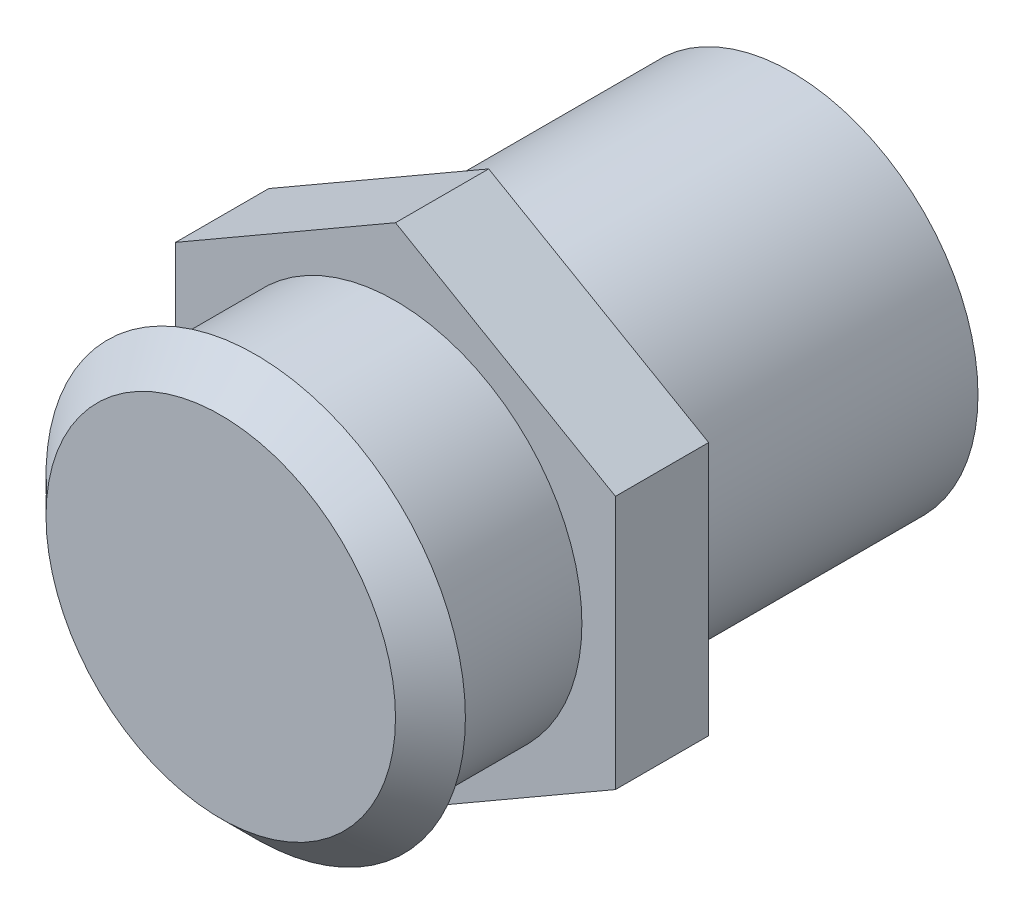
ISO-10303-21;
HEADER;
FILE_DESCRIPTION(('STEP AP214'),'2;1');
FILE_NAME('part.step','',(''),(''),'','','');
FILE_SCHEMA(('AUTOMOTIVE_DESIGN { 1 0 10303 214 1 1 1 1 }'));
ENDSEC;
DATA;
#1=APPLICATION_CONTEXT('core data for automotive mechanical design processes');
#2=APPLICATION_PROTOCOL_DEFINITION('international standard','automotive_design',2000,#1);
#3=PRODUCT_CONTEXT('',#1,'mechanical');
#4=PRODUCT('Part','Part','',(#3));
#5=PRODUCT_RELATED_PRODUCT_CATEGORY('part','',(#4));
#6=PRODUCT_DEFINITION_FORMATION('','',#4);
#7=PRODUCT_DEFINITION_CONTEXT('part definition',#1,'design');
#8=PRODUCT_DEFINITION('design','',#6,#7);
#9=PRODUCT_DEFINITION_SHAPE('','',#8);
#10=(LENGTH_UNIT() NAMED_UNIT(*) SI_UNIT(.MILLI.,.METRE.));
#11=(NAMED_UNIT(*) PLANE_ANGLE_UNIT() SI_UNIT($,.RADIAN.));
#12=(NAMED_UNIT(*) SI_UNIT($,.STERADIAN.) SOLID_ANGLE_UNIT());
#13=UNCERTAINTY_MEASURE_WITH_UNIT(LENGTH_MEASURE(1.E-05),#10,'distance_accuracy_value','');
#14=(GEOMETRIC_REPRESENTATION_CONTEXT(3) GLOBAL_UNCERTAINTY_ASSIGNED_CONTEXT((#13)) GLOBAL_UNIT_ASSIGNED_CONTEXT((#10,
#11,#12)) REPRESENTATION_CONTEXT('',''));
#15=CARTESIAN_POINT('',(0.,0.,0.));
#16=DIRECTION('',(0.,0.,1.));
#17=DIRECTION('',(1.,0.,0.));
#18=AXIS2_PLACEMENT_3D('',#15,#16,#17);
#19=CARTESIAN_POINT('',(0.,0.,23.));
#20=DIRECTION('',(0.,0.,-1.));
#21=DIRECTION('',(-1.,0.,0.));
#22=AXIS2_PLACEMENT_3D('',#19,#20,#21);
#23=CYLINDRICAL_SURFACE('',#22,8.);
#24=CARTESIAN_POINT('',(0.,0.,0.));
#25=DIRECTION('',(0.,0.,1.));
#26=DIRECTION('',(1.,0.,0.));
#27=AXIS2_PLACEMENT_3D('',#24,#25,#26);
#28=CIRCLE('',#27,8.);
#29=CARTESIAN_POINT('',(8.,0.,0.));
#30=VERTEX_POINT('',#29);
#31=EDGE_CURVE('E187',#30,#30,#28,.T.);
#32=ORIENTED_EDGE('',*,*,#31,.T.);
#33=EDGE_LOOP('',(#32));
#34=FACE_BOUND('',#33,.T.);
#35=CARTESIAN_POINT('',(0.,0.,13.));
#36=DIRECTION('',(0.,0.,1.));
#37=DIRECTION('',(1.,0.,0.));
#38=AXIS2_PLACEMENT_3D('',#35,#36,#37);
#39=CIRCLE('',#38,8.);
#40=CARTESIAN_POINT('',(8.,0.,13.));
#41=VERTEX_POINT('',#40);
#42=EDGE_CURVE('E64',#41,#41,#39,.T.);
#43=ORIENTED_EDGE('',*,*,#42,.F.);
#44=EDGE_LOOP('',(#43));
#45=FACE_BOUND('',#44,.T.);
#46=ADVANCED_FACE('F53',(#34,#45),#23,.T.);
#47=CARTESIAN_POINT('',(0.,0.,0.));
#48=DIRECTION('',(0.,0.,1.));
#49=DIRECTION('',(1.,0.,0.));
#50=AXIS2_PLACEMENT_3D('',#47,#48,#49);
#51=PLANE('',#50);
#52=ORIENTED_EDGE('',*,*,#31,.F.);
#53=EDGE_LOOP('',(#52));
#54=FACE_BOUND('',#53,.T.);
#55=ADVANCED_FACE('F199',(#54),#51,.F.);
#56=CARTESIAN_POINT('',(9.43967690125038,5.45,13.));
#57=DIRECTION('',(0.500000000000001,0.866025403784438,0.));
#58=DIRECTION('',(-0.866025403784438,0.500000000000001,0.));
#59=AXIS2_PLACEMENT_3D('',#56,#57,#58);
#60=PLANE('',#59);
#61=DIRECTION('',(-0.866025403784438,0.500000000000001,0.));
#62=VECTOR('',#61,1.);
#63=CARTESIAN_POINT('',(9.43967690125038,5.45,17.));
#64=LINE('',#63,#62);
#65=CARTESIAN_POINT('',(9.43967690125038,5.45,17.));
#66=VERTEX_POINT('',#65);
#67=CARTESIAN_POINT('',(0.,10.9,17.));
#68=VERTEX_POINT('',#67);
#69=EDGE_CURVE('E148',#66,#68,#64,.T.);
#70=ORIENTED_EDGE('',*,*,#69,.F.);
#71=DIRECTION('',(0.,0.,1.));
#72=VECTOR('',#71,1.);
#73=CARTESIAN_POINT('',(9.43967690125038,5.45,13.));
#74=LINE('',#73,#72);
#75=CARTESIAN_POINT('',(9.43967690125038,5.45,13.));
#76=VERTEX_POINT('',#75);
#77=EDGE_CURVE('E72',#76,#66,#74,.T.);
#78=ORIENTED_EDGE('',*,*,#77,.F.);
#79=DIRECTION('',(-0.866025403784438,0.500000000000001,0.));
#80=VECTOR('',#79,1.);
#81=CARTESIAN_POINT('',(9.43967690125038,5.45,13.));
#82=LINE('',#81,#80);
#83=CARTESIAN_POINT('',(0.,10.9,13.));
#84=VERTEX_POINT('',#83);
#85=EDGE_CURVE('E170',#76,#84,#82,.T.);
#86=ORIENTED_EDGE('',*,*,#85,.T.);
#87=DIRECTION('',(0.,0.,1.));
#88=VECTOR('',#87,1.);
#89=CARTESIAN_POINT('',(0.,10.9,13.));
#90=LINE('',#89,#88);
#91=EDGE_CURVE('E107',#84,#68,#90,.T.);
#92=ORIENTED_EDGE('',*,*,#91,.T.);
#93=EDGE_LOOP('',(#70,#78,#86,#92));
#94=FACE_BOUND('',#93,.T.);
#95=ADVANCED_FACE('F206',(#94),#60,.T.);
#96=CARTESIAN_POINT('',(9.43967690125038,-5.45,13.));
#97=DIRECTION('',(1.,0.,0.));
#98=DIRECTION('',(0.,1.,0.));
#99=AXIS2_PLACEMENT_3D('',#96,#97,#98);
#100=PLANE('',#99);
#101=DIRECTION('',(0.,1.,0.));
#102=VECTOR('',#101,1.);
#103=CARTESIAN_POINT('',(9.43967690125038,-5.45,17.));
#104=LINE('',#103,#102);
#105=CARTESIAN_POINT('',(9.43967690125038,-5.45,17.));
#106=VERTEX_POINT('',#105);
#107=EDGE_CURVE('E166',#106,#66,#104,.T.);
#108=ORIENTED_EDGE('',*,*,#107,.F.);
#109=DIRECTION('',(0.,0.,1.));
#110=VECTOR('',#109,1.);
#111=CARTESIAN_POINT('',(9.43967690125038,-5.45,13.));
#112=LINE('',#111,#110);
#113=CARTESIAN_POINT('',(9.43967690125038,-5.45,13.));
#114=VERTEX_POINT('',#113);
#115=EDGE_CURVE('E95',#114,#106,#112,.T.);
#116=ORIENTED_EDGE('',*,*,#115,.F.);
#117=DIRECTION('',(0.,1.,0.));
#118=VECTOR('',#117,1.);
#119=CARTESIAN_POINT('',(9.43967690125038,-5.45,13.));
#120=LINE('',#119,#118);
#121=EDGE_CURVE('E134',#114,#76,#120,.T.);
#122=ORIENTED_EDGE('',*,*,#121,.T.);
#123=ORIENTED_EDGE('',*,*,#77,.T.);
#124=EDGE_LOOP('',(#108,#116,#122,#123));
#125=FACE_BOUND('',#124,.T.);
#126=ADVANCED_FACE('F240',(#125),#100,.T.);
#127=CARTESIAN_POINT('',(0.,-10.9,13.));
#128=DIRECTION('',(0.5,-0.866025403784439,0.));
#129=DIRECTION('',(0.866025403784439,0.5,0.));
#130=AXIS2_PLACEMENT_3D('',#127,#128,#129);
#131=PLANE('',#130);
#132=DIRECTION('',(0.866025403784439,0.5,0.));
#133=VECTOR('',#132,1.);
#134=CARTESIAN_POINT('',(0.,-10.9,17.));
#135=LINE('',#134,#133);
#136=CARTESIAN_POINT('',(0.,-10.9,17.));
#137=VERTEX_POINT('',#136);
#138=EDGE_CURVE('E120',#137,#106,#135,.T.);
#139=ORIENTED_EDGE('',*,*,#138,.F.);
#140=DIRECTION('',(0.,0.,1.));
#141=VECTOR('',#140,1.);
#142=CARTESIAN_POINT('',(0.,-10.9,13.));
#143=LINE('',#142,#141);
#144=CARTESIAN_POINT('',(0.,-10.9,13.));
#145=VERTEX_POINT('',#144);
#146=EDGE_CURVE('E115',#145,#137,#143,.T.);
#147=ORIENTED_EDGE('',*,*,#146,.F.);
#148=DIRECTION('',(0.866025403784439,0.5,0.));
#149=VECTOR('',#148,1.);
#150=CARTESIAN_POINT('',(0.,-10.9,13.));
#151=LINE('',#150,#149);
#152=EDGE_CURVE('E118',#145,#114,#151,.T.);
#153=ORIENTED_EDGE('',*,*,#152,.T.);
#154=ORIENTED_EDGE('',*,*,#115,.T.);
#155=EDGE_LOOP('',(#139,#147,#153,#154));
#156=FACE_BOUND('',#155,.T.);
#157=ADVANCED_FACE('F117',(#156),#131,.T.);
#158=CARTESIAN_POINT('',(-9.43967690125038,-5.45,13.));
#159=DIRECTION('',(-0.5,-0.866025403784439,0.));
#160=DIRECTION('',(0.866025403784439,-0.5,0.));
#161=AXIS2_PLACEMENT_3D('',#158,#159,#160);
#162=PLANE('',#161);
#163=DIRECTION('',(0.866025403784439,-0.5,0.));
#164=VECTOR('',#163,1.);
#165=CARTESIAN_POINT('',(-9.43967690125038,-5.45,17.));
#166=LINE('',#165,#164);
#167=CARTESIAN_POINT('',(-9.43967690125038,-5.45,17.));
#168=VERTEX_POINT('',#167);
#169=EDGE_CURVE('E161',#168,#137,#166,.T.);
#170=ORIENTED_EDGE('',*,*,#169,.F.);
#171=DIRECTION('',(0.,0.,1.));
#172=VECTOR('',#171,1.);
#173=CARTESIAN_POINT('',(-9.43967690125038,-5.45,13.));
#174=LINE('',#173,#172);
#175=CARTESIAN_POINT('',(-9.43967690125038,-5.45,13.));
#176=VERTEX_POINT('',#175);
#177=EDGE_CURVE('E126',#176,#168,#174,.T.);
#178=ORIENTED_EDGE('',*,*,#177,.F.);
#179=DIRECTION('',(0.866025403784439,-0.5,0.));
#180=VECTOR('',#179,1.);
#181=CARTESIAN_POINT('',(-9.43967690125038,-5.45,13.));
#182=LINE('',#181,#180);
#183=EDGE_CURVE('E132',#176,#145,#182,.T.);
#184=ORIENTED_EDGE('',*,*,#183,.T.);
#185=ORIENTED_EDGE('',*,*,#146,.T.);
#186=EDGE_LOOP('',(#170,#178,#184,#185));
#187=FACE_BOUND('',#186,.T.);
#188=ADVANCED_FACE('F137',(#187),#162,.T.);
#189=CARTESIAN_POINT('',(-9.43967690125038,5.45,13.));
#190=DIRECTION('',(-1.,0.,0.));
#191=DIRECTION('',(0.,0.,1.));
#192=AXIS2_PLACEMENT_3D('',#189,#190,#191);
#193=PLANE('',#192);
#194=DIRECTION('',(0.,-1.,0.));
#195=VECTOR('',#194,1.);
#196=CARTESIAN_POINT('',(-9.43967690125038,5.45,17.));
#197=LINE('',#196,#195);
#198=CARTESIAN_POINT('',(-9.43967690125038,5.45,17.));
#199=VERTEX_POINT('',#198);
#200=EDGE_CURVE('E157',#199,#168,#197,.T.);
#201=ORIENTED_EDGE('',*,*,#200,.F.);
#202=DIRECTION('',(0.,0.,1.));
#203=VECTOR('',#202,1.);
#204=CARTESIAN_POINT('',(-9.43967690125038,5.45,13.));
#205=LINE('',#204,#203);
#206=CARTESIAN_POINT('',(-9.43967690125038,5.45,13.));
#207=VERTEX_POINT('',#206);
#208=EDGE_CURVE('E178',#207,#199,#205,.T.);
#209=ORIENTED_EDGE('',*,*,#208,.F.);
#210=DIRECTION('',(0.,-1.,0.));
#211=VECTOR('',#210,1.);
#212=CARTESIAN_POINT('',(-9.43967690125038,5.45,13.));
#213=LINE('',#212,#211);
#214=EDGE_CURVE('E139',#207,#176,#213,.T.);
#215=ORIENTED_EDGE('',*,*,#214,.T.);
#216=ORIENTED_EDGE('',*,*,#177,.T.);
#217=EDGE_LOOP('',(#201,#209,#215,#216));
#218=FACE_BOUND('',#217,.T.);
#219=ADVANCED_FACE('F252',(#218),#193,.T.);
#220=CARTESIAN_POINT('',(0.,10.9,13.));
#221=DIRECTION('',(-0.5,0.866025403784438,0.));
#222=DIRECTION('',(-0.866025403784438,-0.5,0.));
#223=AXIS2_PLACEMENT_3D('',#220,#221,#222);
#224=PLANE('',#223);
#225=DIRECTION('',(-0.866025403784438,-0.5,0.));
#226=VECTOR('',#225,1.);
#227=CARTESIAN_POINT('',(0.,10.9,17.));
#228=LINE('',#227,#226);
#229=EDGE_CURVE('E152',#68,#199,#228,.T.);
#230=ORIENTED_EDGE('',*,*,#229,.F.);
#231=ORIENTED_EDGE('',*,*,#91,.F.);
#232=DIRECTION('',(-0.866025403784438,-0.5,0.));
#233=VECTOR('',#232,1.);
#234=CARTESIAN_POINT('',(0.,10.9,13.));
#235=LINE('',#234,#233);
#236=EDGE_CURVE('E142',#84,#207,#235,.T.);
#237=ORIENTED_EDGE('',*,*,#236,.T.);
#238=ORIENTED_EDGE('',*,*,#208,.T.);
#239=EDGE_LOOP('',(#230,#231,#237,#238));
#240=FACE_BOUND('',#239,.T.);
#241=ADVANCED_FACE('F237',(#240),#224,.T.);
#242=CARTESIAN_POINT('',(0.,0.,13.));
#243=DIRECTION('',(0.,0.,1.));
#244=DIRECTION('',(1.,0.,0.));
#245=AXIS2_PLACEMENT_3D('',#242,#243,#244);
#246=PLANE('',#245);
#247=ORIENTED_EDGE('',*,*,#42,.T.);
#248=EDGE_LOOP('',(#247));
#249=FACE_BOUND('',#248,.T.);
#250=ORIENTED_EDGE('',*,*,#85,.F.);
#251=ORIENTED_EDGE('',*,*,#121,.F.);
#252=ORIENTED_EDGE('',*,*,#152,.F.);
#253=ORIENTED_EDGE('',*,*,#183,.F.);
#254=ORIENTED_EDGE('',*,*,#214,.F.);
#255=ORIENTED_EDGE('',*,*,#236,.F.);
#256=EDGE_LOOP('',(#250,#251,#252,#253,#254,#255));
#257=FACE_BOUND('',#256,.T.);
#258=ADVANCED_FACE('F130',(#249,#257),#246,.F.);
#259=CARTESIAN_POINT('',(0.,0.,17.));
#260=DIRECTION('',(0.,0.,1.));
#261=DIRECTION('',(1.,0.,0.));
#262=AXIS2_PLACEMENT_3D('',#259,#260,#261);
#263=PLANE('',#262);
#264=CARTESIAN_POINT('',(0.,0.,17.));
#265=DIRECTION('',(0.,0.,1.));
#266=DIRECTION('',(1.,0.,0.));
#267=AXIS2_PLACEMENT_3D('',#264,#265,#266);
#268=CIRCLE('',#267,8.);
#269=CARTESIAN_POINT('',(8.,0.,17.));
#270=VERTEX_POINT('',#269);
#271=EDGE_CURVE('E173',#270,#270,#268,.T.);
#272=ORIENTED_EDGE('',*,*,#271,.F.);
#273=EDGE_LOOP('',(#272));
#274=FACE_BOUND('',#273,.T.);
#275=ORIENTED_EDGE('',*,*,#69,.T.);
#276=ORIENTED_EDGE('',*,*,#229,.T.);
#277=ORIENTED_EDGE('',*,*,#200,.T.);
#278=ORIENTED_EDGE('',*,*,#169,.T.);
#279=ORIENTED_EDGE('',*,*,#138,.T.);
#280=ORIENTED_EDGE('',*,*,#107,.T.);
#281=EDGE_LOOP('',(#275,#276,#277,#278,#279,#280));
#282=FACE_BOUND('',#281,.T.);
#283=ADVANCED_FACE('F211',(#274,#282),#263,.T.);
#284=ORIENTED_EDGE('',*,*,#271,.T.);
#285=EDGE_LOOP('',(#284));
#286=FACE_BOUND('',#285,.T.);
#287=CARTESIAN_POINT('',(0.,0.,23.));
#288=DIRECTION('',(0.,0.,1.));
#289=DIRECTION('',(1.,0.,0.));
#290=AXIS2_PLACEMENT_3D('',#287,#288,#289);
#291=CIRCLE('',#290,8.);
#292=CARTESIAN_POINT('',(8.,0.,23.));
#293=VERTEX_POINT('',#292);
#294=EDGE_CURVE('E183',#293,#293,#291,.T.);
#295=ORIENTED_EDGE('',*,*,#294,.F.);
#296=EDGE_LOOP('',(#295));
#297=FACE_BOUND('',#296,.T.);
#298=ADVANCED_FACE('F201',(#286,#297),#23,.T.);
#299=CARTESIAN_POINT('',(0.,0.,24.5));
#300=DIRECTION('',(0.,0.,1.));
#301=DIRECTION('',(1.,0.,0.));
#302=AXIS2_PLACEMENT_3D('',#299,#300,#301);
#303=PLANE('',#302);
#304=CARTESIAN_POINT('',(0.,0.,24.5));
#305=DIRECTION('',(0.,0.,1.));
#306=DIRECTION('',(1.,0.,0.));
#307=AXIS2_PLACEMENT_3D('',#304,#305,#306);
#308=CIRCLE('',#307,7.5);
#309=CARTESIAN_POINT('',(7.5,0.,24.5));
#310=VERTEX_POINT('',#309);
#311=EDGE_CURVE('E11',#310,#310,#308,.T.);
#312=ORIENTED_EDGE('',*,*,#311,.T.);
#313=EDGE_LOOP('',(#312));
#314=FACE_BOUND('',#313,.T.);
#315=ADVANCED_FACE('F210',(#314),#303,.T.);
#316=CARTESIAN_POINT('',(0.,0.,23.));
#317=DIRECTION('',(0.,0.,1.));
#318=DIRECTION('',(1.,0.,0.));
#319=AXIS2_PLACEMENT_3D('',#316,#317,#318);
#320=PLANE('',#319);
#321=ORIENTED_EDGE('',*,*,#294,.T.);
#322=EDGE_LOOP('',(#321));
#323=FACE_BOUND('',#322,.T.);
#324=CARTESIAN_POINT('',(0.,0.,23.));
#325=DIRECTION('',(0.,0.,1.));
#326=DIRECTION('',(1.,0.,0.));
#327=AXIS2_PLACEMENT_3D('',#324,#325,#326);
#328=CIRCLE('',#327,9.);
#329=CARTESIAN_POINT('',(9.,0.,23.));
#330=VERTEX_POINT('',#329);
#331=EDGE_CURVE('E153',#330,#330,#328,.T.);
#332=ORIENTED_EDGE('',*,*,#331,.F.);
#333=EDGE_LOOP('',(#332));
#334=FACE_BOUND('',#333,.T.);
#335=ADVANCED_FACE('F218',(#323,#334),#320,.F.);
#336=CARTESIAN_POINT('',(0.,0.,24.5));
#337=DIRECTION('',(0.,0.,-1.));
#338=DIRECTION('',(-1.,0.,0.));
#339=AXIS2_PLACEMENT_3D('',#336,#337,#338);
#340=CONICAL_SURFACE('',#339,7.5,0.785398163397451);
#341=ORIENTED_EDGE('',*,*,#331,.T.);
#342=EDGE_LOOP('',(#341));
#343=FACE_BOUND('',#342,.T.);
#344=ORIENTED_EDGE('',*,*,#311,.F.);
#345=EDGE_LOOP('',(#344));
#346=FACE_BOUND('',#345,.T.);
#347=ADVANCED_FACE('F56',(#343,#346),#340,.T.);
#348=CLOSED_SHELL('',(#46,#55,#95,#126,#157,#188,#219,#241,#258,#283,#298,#315,#335,#347));
#349=MANIFOLD_SOLID_BREP('B2',#348);
#350=ADVANCED_BREP_SHAPE_REPRESENTATION('',(#18,#349),#14);
#351=SHAPE_DEFINITION_REPRESENTATION(#9,#350);
ENDSEC;
END-ISO-10303-21;
